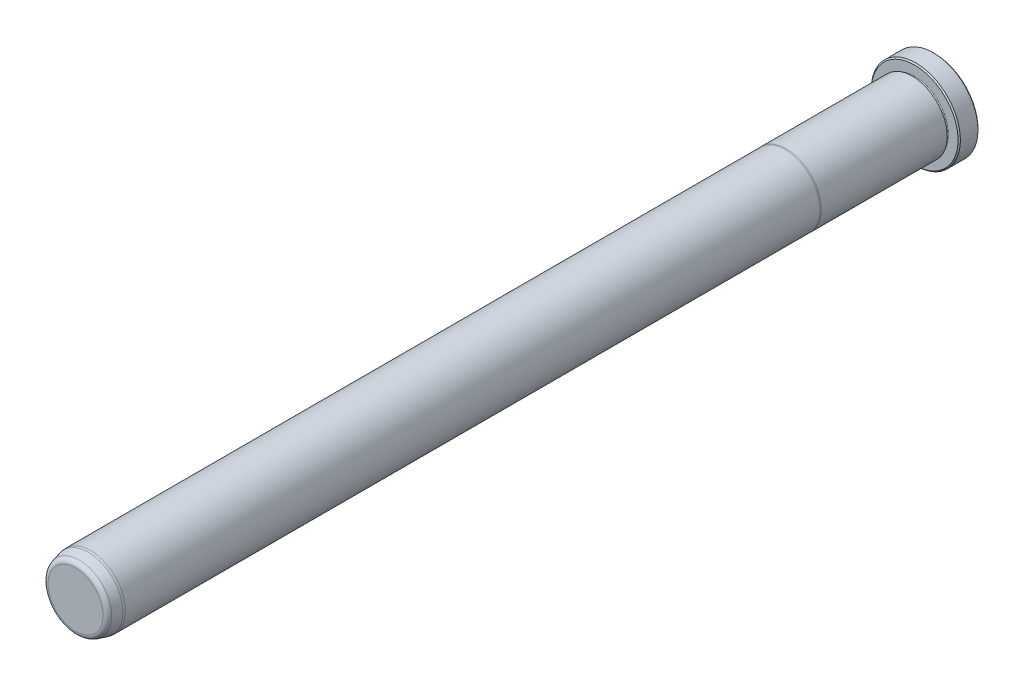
ISO-10303-21;
HEADER;
FILE_DESCRIPTION(('STEP AP214'),'2;1');
FILE_NAME('part.step','',(''),(''),'','','');
FILE_SCHEMA(('AUTOMOTIVE_DESIGN { 1 0 10303 214 1 1 1 1 }'));
ENDSEC;
DATA;
#1=APPLICATION_CONTEXT('core data for automotive mechanical design processes');
#2=APPLICATION_PROTOCOL_DEFINITION('international standard','automotive_design',2000,#1);
#3=PRODUCT_CONTEXT('',#1,'mechanical');
#4=PRODUCT('Part','Part','',(#3));
#5=PRODUCT_RELATED_PRODUCT_CATEGORY('part','',(#4));
#6=PRODUCT_DEFINITION_FORMATION('','',#4);
#7=PRODUCT_DEFINITION_CONTEXT('part definition',#1,'design');
#8=PRODUCT_DEFINITION('design','',#6,#7);
#9=PRODUCT_DEFINITION_SHAPE('','',#8);
#10=(LENGTH_UNIT() NAMED_UNIT(*) SI_UNIT(.MILLI.,.METRE.));
#11=(NAMED_UNIT(*) PLANE_ANGLE_UNIT() SI_UNIT($,.RADIAN.));
#12=(NAMED_UNIT(*) SI_UNIT($,.STERADIAN.) SOLID_ANGLE_UNIT());
#13=UNCERTAINTY_MEASURE_WITH_UNIT(LENGTH_MEASURE(1.E-05),#10,'distance_accuracy_value','');
#14=(GEOMETRIC_REPRESENTATION_CONTEXT(3) GLOBAL_UNCERTAINTY_ASSIGNED_CONTEXT((#13)) GLOBAL_UNIT_ASSIGNED_CONTEXT((#10,
#11,#12)) REPRESENTATION_CONTEXT('',''));
#15=CARTESIAN_POINT('',(0.,0.,0.));
#16=DIRECTION('',(0.,0.,1.));
#17=DIRECTION('',(1.,0.,0.));
#18=AXIS2_PLACEMENT_3D('',#15,#16,#17);
#19=CARTESIAN_POINT('',(0.,0.,0.));
#20=DIRECTION('',(0.,0.,1.));
#21=DIRECTION('',(1.,0.,0.));
#22=AXIS2_PLACEMENT_3D('',#19,#20,#21);
#23=PLANE('',#22);
#24=CARTESIAN_POINT('',(0.,0.,0.));
#25=DIRECTION('',(0.,0.,1.));
#26=DIRECTION('',(1.,0.,0.));
#27=AXIS2_PLACEMENT_3D('',#24,#25,#26);
#28=CIRCLE('',#27,13.7795);
#29=CARTESIAN_POINT('',(13.7795,0.,0.));
#30=VERTEX_POINT('',#29);
#31=EDGE_CURVE('E37',#30,#30,#28,.F.);
#32=ORIENTED_EDGE('',*,*,#31,.T.);
#33=EDGE_LOOP('',(#32));
#34=FACE_BOUND('',#33,.T.);
#35=ADVANCED_FACE('F30',(#34),#23,.F.);
#36=CARTESIAN_POINT('',(0.,0.,0.));
#37=DIRECTION('',(0.,0.,1.));
#38=DIRECTION('',(1.,0.,0.));
#39=AXIS2_PLACEMENT_3D('',#36,#37,#38);
#40=CYLINDRICAL_SURFACE('',#39,14.1605);
#41=CARTESIAN_POINT('',(0.,0.,0.381000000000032));
#42=DIRECTION('',(0.,0.,1.));
#43=DIRECTION('',(1.,0.,0.));
#44=AXIS2_PLACEMENT_3D('',#41,#42,#43);
#45=CIRCLE('',#44,14.1605);
#46=CARTESIAN_POINT('',(14.1605,0.,0.381000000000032));
#47=VERTEX_POINT('',#46);
#48=EDGE_CURVE('E41',#47,#47,#45,.T.);
#49=ORIENTED_EDGE('',*,*,#48,.T.);
#50=EDGE_LOOP('',(#49));
#51=FACE_BOUND('',#50,.T.);
#52=CARTESIAN_POINT('',(0.,0.,5.96899999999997));
#53=DIRECTION('',(0.,0.,-1.));
#54=DIRECTION('',(-1.,0.,0.));
#55=AXIS2_PLACEMENT_3D('',#52,#53,#54);
#56=CIRCLE('',#55,14.1605);
#57=CARTESIAN_POINT('',(-14.1605,0.,5.96899999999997));
#58=VERTEX_POINT('',#57);
#59=EDGE_CURVE('E45',#58,#58,#56,.T.);
#60=ORIENTED_EDGE('',*,*,#59,.T.);
#61=EDGE_LOOP('',(#60));
#62=FACE_BOUND('',#61,.T.);
#63=ADVANCED_FACE('F118',(#51,#62),#40,.T.);
#64=CARTESIAN_POINT('',(0.,14.1605,6.35));
#65=DIRECTION('',(0.,0.,-1.));
#66=DIRECTION('',(-1.,0.,0.));
#67=AXIS2_PLACEMENT_3D('',#64,#65,#66);
#68=PLANE('',#67);
#69=CARTESIAN_POINT('',(0.,0.,6.35));
#70=DIRECTION('',(0.,0.,-1.));
#71=DIRECTION('',(-1.,0.,0.));
#72=AXIS2_PLACEMENT_3D('',#69,#70,#71);
#73=CIRCLE('',#72,13.7795);
#74=CARTESIAN_POINT('',(-13.7795,0.,6.35));
#75=VERTEX_POINT('',#74);
#76=EDGE_CURVE('E10',#75,#75,#73,.F.);
#77=ORIENTED_EDGE('',*,*,#76,.T.);
#78=EDGE_LOOP('',(#77));
#79=FACE_BOUND('',#78,.T.);
#80=CARTESIAN_POINT('',(0.,0.,6.35));
#81=DIRECTION('',(0.,0.,1.));
#82=DIRECTION('',(1.,0.,0.));
#83=AXIS2_PLACEMENT_3D('',#80,#81,#82);
#84=CIRCLE('',#83,10.7188);
#85=CARTESIAN_POINT('',(10.7188,0.,6.35));
#86=VERTEX_POINT('',#85);
#87=EDGE_CURVE('E56',#86,#86,#84,.T.);
#88=ORIENTED_EDGE('',*,*,#87,.F.);
#89=EDGE_LOOP('',(#88));
#90=FACE_BOUND('',#89,.T.);
#91=ADVANCED_FACE('F113',(#79,#90),#68,.F.);
#92=CARTESIAN_POINT('',(0.,0.,6.731));
#93=DIRECTION('',(0.,0.,1.));
#94=DIRECTION('',(1.,0.,0.));
#95=AXIS2_PLACEMENT_3D('',#92,#93,#94);
#96=TOROIDAL_SURFACE('',#95,10.7188,0.381000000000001);
#97=CARTESIAN_POINT('',(0.,0.,7.112));
#98=DIRECTION('',(0.,0.,1.));
#99=DIRECTION('',(1.,0.,0.));
#100=AXIS2_PLACEMENT_3D('',#97,#98,#99);
#101=CIRCLE('',#100,10.7188);
#102=CARTESIAN_POINT('',(10.7188,0.,7.112));
#103=VERTEX_POINT('',#102);
#104=EDGE_CURVE('E59',#103,#103,#101,.T.);
#105=ORIENTED_EDGE('',*,*,#104,.F.);
#106=EDGE_LOOP('',(#105));
#107=FACE_BOUND('',#106,.T.);
#108=ORIENTED_EDGE('',*,*,#87,.T.);
#109=EDGE_LOOP('',(#108));
#110=FACE_BOUND('',#109,.T.);
#111=ADVANCED_FACE('F107',(#107,#110),#96,.F.);
#112=CARTESIAN_POINT('',(0.,10.7188,7.112));
#113=DIRECTION('',(0.,0.,1.));
#114=DIRECTION('',(1.,0.,0.));
#115=AXIS2_PLACEMENT_3D('',#112,#113,#114);
#116=PLANE('',#115);
#117=CARTESIAN_POINT('',(0.,0.,7.112));
#118=DIRECTION('',(0.,0.,1.));
#119=DIRECTION('',(1.,0.,0.));
#120=AXIS2_PLACEMENT_3D('',#117,#118,#119);
#121=CIRCLE('',#120,11.1252);
#122=CARTESIAN_POINT('',(11.1252,0.,7.112));
#123=VERTEX_POINT('',#122);
#124=EDGE_CURVE('E62',#123,#123,#121,.T.);
#125=ORIENTED_EDGE('',*,*,#124,.F.);
#126=EDGE_LOOP('',(#125));
#127=FACE_BOUND('',#126,.T.);
#128=ORIENTED_EDGE('',*,*,#104,.T.);
#129=EDGE_LOOP('',(#128));
#130=FACE_BOUND('',#129,.T.);
#131=ADVANCED_FACE('F101',(#127,#130),#116,.F.);
#132=CARTESIAN_POINT('',(0.,0.,0.));
#133=DIRECTION('',(0.,0.,1.));
#134=DIRECTION('',(1.,0.,0.));
#135=AXIS2_PLACEMENT_3D('',#132,#133,#134);
#136=CYLINDRICAL_SURFACE('',#135,11.1252);
#137=CARTESIAN_POINT('',(0.,0.,47.1347630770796));
#138=DIRECTION('',(0.,0.,1.));
#139=DIRECTION('',(1.,0.,0.));
#140=AXIS2_PLACEMENT_3D('',#137,#138,#139);
#141=CIRCLE('',#140,11.1252);
#142=CARTESIAN_POINT('',(11.1252,0.,47.1347630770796));
#143=VERTEX_POINT('',#142);
#144=EDGE_CURVE('E65',#143,#143,#141,.T.);
#145=ORIENTED_EDGE('',*,*,#144,.F.);
#146=EDGE_LOOP('',(#145));
#147=FACE_BOUND('',#146,.T.);
#148=ORIENTED_EDGE('',*,*,#124,.T.);
#149=EDGE_LOOP('',(#148));
#150=FACE_BOUND('',#149,.T.);
#151=ADVANCED_FACE('F95',(#147,#150),#136,.T.);
#152=CARTESIAN_POINT('',(0.,0.,47.1347630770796));
#153=DIRECTION('',(0.,0.,-1.));
#154=DIRECTION('',(-1.,0.,0.));
#155=AXIS2_PLACEMENT_3D('',#152,#153,#154);
#156=CONICAL_SURFACE('',#155,11.1252,0.0698131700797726);
#157=CARTESIAN_POINT('',(0.,0.,47.498));
#158=DIRECTION('',(0.,0.,1.));
#159=DIRECTION('',(1.,0.,0.));
#160=AXIS2_PLACEMENT_3D('',#157,#158,#159);
#161=CIRCLE('',#160,11.0998);
#162=CARTESIAN_POINT('',(11.0998,0.,47.498));
#163=VERTEX_POINT('',#162);
#164=EDGE_CURVE('E68',#163,#163,#161,.T.);
#165=ORIENTED_EDGE('',*,*,#164,.F.);
#166=EDGE_LOOP('',(#165));
#167=FACE_BOUND('',#166,.T.);
#168=ORIENTED_EDGE('',*,*,#144,.T.);
#169=EDGE_LOOP('',(#168));
#170=FACE_BOUND('',#169,.T.);
#171=ADVANCED_FACE('F89',(#167,#170),#156,.T.);
#172=CARTESIAN_POINT('',(0.,0.,0.));
#173=DIRECTION('',(0.,0.,1.));
#174=DIRECTION('',(1.,0.,0.));
#175=AXIS2_PLACEMENT_3D('',#172,#173,#174);
#176=CYLINDRICAL_SURFACE('',#175,11.0998);
#177=CARTESIAN_POINT('',(0.,0.,268.2875));
#178=DIRECTION('',(0.,0.,1.));
#179=DIRECTION('',(1.,0.,0.));
#180=AXIS2_PLACEMENT_3D('',#177,#178,#179);
#181=CIRCLE('',#180,11.0998);
#182=CARTESIAN_POINT('',(11.0998,0.,268.2875));
#183=VERTEX_POINT('',#182);
#184=EDGE_CURVE('E71',#183,#183,#181,.T.);
#185=ORIENTED_EDGE('',*,*,#184,.F.);
#186=EDGE_LOOP('',(#185));
#187=FACE_BOUND('',#186,.T.);
#188=ORIENTED_EDGE('',*,*,#164,.T.);
#189=EDGE_LOOP('',(#188));
#190=FACE_BOUND('',#189,.T.);
#191=ADVANCED_FACE('F83',(#187,#190),#176,.T.);
#192=CARTESIAN_POINT('',(0.,0.,268.2875));
#193=DIRECTION('',(0.,0.,-1.));
#194=DIRECTION('',(-1.,0.,0.));
#195=AXIS2_PLACEMENT_3D('',#192,#193,#194);
#196=CONICAL_SURFACE('',#195,11.0998,0.0872664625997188);
#197=CARTESIAN_POINT('',(0.,0.,269.0495));
#198=DIRECTION('',(0.,0.,1.));
#199=DIRECTION('',(1.,0.,0.));
#200=AXIS2_PLACEMENT_3D('',#197,#198,#199);
#201=CIRCLE('',#200,11.0331336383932);
#202=CARTESIAN_POINT('',(11.0331336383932,0.,269.0495));
#203=VERTEX_POINT('',#202);
#204=EDGE_CURVE('E74',#203,#203,#201,.T.);
#205=ORIENTED_EDGE('',*,*,#204,.F.);
#206=EDGE_LOOP('',(#205));
#207=FACE_BOUND('',#206,.T.);
#208=ORIENTED_EDGE('',*,*,#184,.T.);
#209=EDGE_LOOP('',(#208));
#210=FACE_BOUND('',#209,.T.);
#211=ADVANCED_FACE('F80',(#207,#210),#196,.T.);
#212=CARTESIAN_POINT('',(0.,0.,269.0495));
#213=DIRECTION('',(0.,0.,-1.));
#214=DIRECTION('',(-1.,0.,0.));
#215=AXIS2_PLACEMENT_3D('',#212,#213,#214);
#216=CONICAL_SURFACE('',#215,11.0331336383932,0.26179938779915);
#217=CARTESIAN_POINT('',(0.,0.,271.8733752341));
#218=DIRECTION('',(0.,0.,1.));
#219=DIRECTION('',(1.,0.,0.));
#220=AXIS2_PLACEMENT_3D('',#217,#218,#219);
#221=CIRCLE('',#220,10.2764785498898);
#222=CARTESIAN_POINT('',(10.2764785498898,0.,271.8733752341));
#223=VERTEX_POINT('',#222);
#224=EDGE_CURVE('E50',#223,#223,#221,.F.);
#225=ORIENTED_EDGE('',*,*,#224,.T.);
#226=EDGE_LOOP('',(#225));
#227=FACE_BOUND('',#226,.T.);
#228=ORIENTED_EDGE('',*,*,#204,.T.);
#229=EDGE_LOOP('',(#228));
#230=FACE_BOUND('',#229,.T.);
#231=ADVANCED_FACE('F78',(#227,#230),#216,.T.);
#232=CARTESIAN_POINT('',(0.,9.96120289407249,273.05));
#233=DIRECTION('',(0.,0.,-1.));
#234=DIRECTION('',(-1.,0.,0.));
#235=AXIS2_PLACEMENT_3D('',#232,#233,#234);
#236=PLANE('',#235);
#237=CARTESIAN_POINT('',(0.,0.,273.05));
#238=DIRECTION('',(0.,0.,-1.));
#239=DIRECTION('',(-1.,0.,0.));
#240=AXIS2_PLACEMENT_3D('',#237,#238,#239);
#241=CIRCLE('',#240,8.74307130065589);
#242=CARTESIAN_POINT('',(-8.74307130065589,0.,273.05));
#243=VERTEX_POINT('',#242);
#244=EDGE_CURVE('E53',#243,#243,#241,.F.);
#245=ORIENTED_EDGE('',*,*,#244,.T.);
#246=EDGE_LOOP('',(#245));
#247=FACE_BOUND('',#246,.T.);
#248=ADVANCED_FACE('F133',(#247),#236,.F.);
#249=CARTESIAN_POINT('',(0.,0.,271.4625));
#250=DIRECTION('',(0.,0.,-1.));
#251=DIRECTION('',(-1.,0.,0.));
#252=AXIS2_PLACEMENT_3D('',#249,#250,#251);
#253=TOROIDAL_SURFACE('',#252,8.74307130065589,1.5875);
#254=ORIENTED_EDGE('',*,*,#224,.F.);
#255=EDGE_LOOP('',(#254));
#256=FACE_BOUND('',#255,.T.);
#257=ORIENTED_EDGE('',*,*,#244,.F.);
#258=EDGE_LOOP('',(#257));
#259=FACE_BOUND('',#258,.T.);
#260=ADVANCED_FACE('F130',(#256,#259),#253,.T.);
#261=CARTESIAN_POINT('',(0.,0.,0.381000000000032));
#262=DIRECTION('',(0.,0.,1.));
#263=DIRECTION('',(1.,0.,0.));
#264=AXIS2_PLACEMENT_3D('',#261,#262,#263);
#265=CONICAL_SURFACE('',#264,14.1605,0.785398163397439);
#266=ORIENTED_EDGE('',*,*,#31,.F.);
#267=EDGE_LOOP('',(#266));
#268=FACE_BOUND('',#267,.T.);
#269=ORIENTED_EDGE('',*,*,#48,.F.);
#270=EDGE_LOOP('',(#269));
#271=FACE_BOUND('',#270,.T.);
#272=ADVANCED_FACE('F132',(#268,#271),#265,.T.);
#273=CARTESIAN_POINT('',(0.,0.,6.35));
#274=DIRECTION('',(0.,0.,-1.));
#275=DIRECTION('',(-1.,0.,0.));
#276=AXIS2_PLACEMENT_3D('',#273,#274,#275);
#277=CONICAL_SURFACE('',#276,13.7795,0.785398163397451);
#278=ORIENTED_EDGE('',*,*,#59,.F.);
#279=EDGE_LOOP('',(#278));
#280=FACE_BOUND('',#279,.T.);
#281=ORIENTED_EDGE('',*,*,#76,.F.);
#282=EDGE_LOOP('',(#281));
#283=FACE_BOUND('',#282,.T.);
#284=ADVANCED_FACE('F32',(#280,#283),#277,.T.);
#285=CLOSED_SHELL('',(#35,#63,#91,#111,#131,#151,#171,#191,#211,#231,#248,#260,#272,#284));
#286=MANIFOLD_SOLID_BREP('B2',#285);
#287=ADVANCED_BREP_SHAPE_REPRESENTATION('',(#18,#286),#14);
#288=SHAPE_DEFINITION_REPRESENTATION(#9,#287);
ENDSEC;
END-ISO-10303-21;
